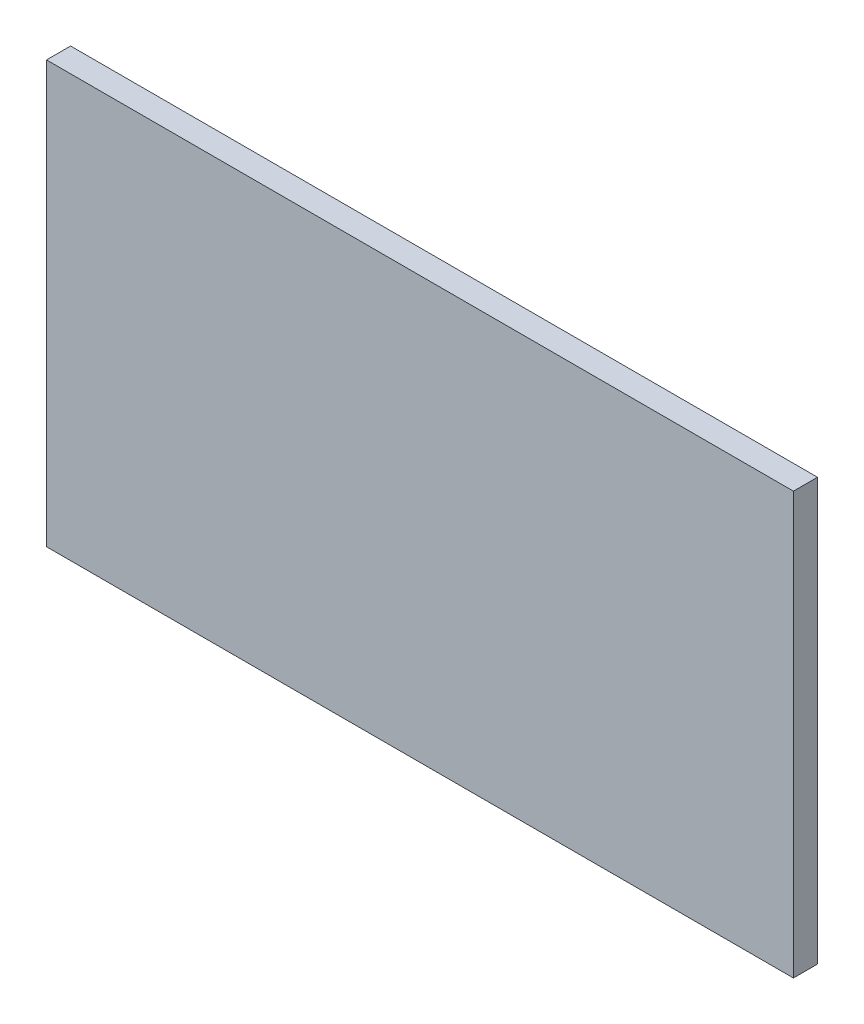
ISO-10303-21;
HEADER;
FILE_DESCRIPTION(('STEP AP214'),'2;1');
FILE_NAME('part.step','',(''),(''),'','','');
FILE_SCHEMA(('AUTOMOTIVE_DESIGN { 1 0 10303 214 1 1 1 1 }'));
ENDSEC;
DATA;
#1=APPLICATION_CONTEXT('core data for automotive mechanical design processes');
#2=APPLICATION_PROTOCOL_DEFINITION('international standard','automotive_design',2000,#1);
#3=PRODUCT_CONTEXT('',#1,'mechanical');
#4=PRODUCT('Part','Part','',(#3));
#5=PRODUCT_RELATED_PRODUCT_CATEGORY('part','',(#4));
#6=PRODUCT_DEFINITION_FORMATION('','',#4);
#7=PRODUCT_DEFINITION_CONTEXT('part definition',#1,'design');
#8=PRODUCT_DEFINITION('design','',#6,#7);
#9=PRODUCT_DEFINITION_SHAPE('','',#8);
#10=(LENGTH_UNIT() NAMED_UNIT(*) SI_UNIT(.MILLI.,.METRE.));
#11=(NAMED_UNIT(*) PLANE_ANGLE_UNIT() SI_UNIT($,.RADIAN.));
#12=(NAMED_UNIT(*) SI_UNIT($,.STERADIAN.) SOLID_ANGLE_UNIT());
#13=UNCERTAINTY_MEASURE_WITH_UNIT(LENGTH_MEASURE(1.E-05),#10,'distance_accuracy_value','');
#14=(GEOMETRIC_REPRESENTATION_CONTEXT(3) GLOBAL_UNCERTAINTY_ASSIGNED_CONTEXT((#13)) GLOBAL_UNIT_ASSIGNED_CONTEXT((#10,
#11,#12)) REPRESENTATION_CONTEXT('',''));
#15=CARTESIAN_POINT('',(0.,0.,0.));
#16=DIRECTION('',(0.,0.,1.));
#17=DIRECTION('',(1.,0.,0.));
#18=AXIS2_PLACEMENT_3D('',#15,#16,#17);
#19=CARTESIAN_POINT('',(310.,-175.,10.));
#20=DIRECTION('',(-1.,0.,0.));
#21=DIRECTION('',(0.,0.,1.));
#22=AXIS2_PLACEMENT_3D('',#19,#20,#21);
#23=PLANE('',#22);
#24=DIRECTION('',(0.,1.,0.));
#25=VECTOR('',#24,1.);
#26=CARTESIAN_POINT('',(310.,-175.,-10.));
#27=LINE('',#26,#25);
#28=CARTESIAN_POINT('',(310.,-175.,-10.));
#29=VERTEX_POINT('',#28);
#30=CARTESIAN_POINT('',(310.,175.,-10.));
#31=VERTEX_POINT('',#30);
#32=EDGE_CURVE('E96',#29,#31,#27,.T.);
#33=ORIENTED_EDGE('',*,*,#32,.T.);
#34=DIRECTION('',(0.,0.,-1.));
#35=VECTOR('',#34,1.);
#36=CARTESIAN_POINT('',(310.,175.,10.));
#37=LINE('',#36,#35);
#38=CARTESIAN_POINT('',(310.,175.,10.));
#39=VERTEX_POINT('',#38);
#40=EDGE_CURVE('E11',#39,#31,#37,.T.);
#41=ORIENTED_EDGE('',*,*,#40,.F.);
#42=DIRECTION('',(0.,1.,0.));
#43=VECTOR('',#42,1.);
#44=CARTESIAN_POINT('',(310.,-175.,10.));
#45=LINE('',#44,#43);
#46=CARTESIAN_POINT('',(310.,-175.,10.));
#47=VERTEX_POINT('',#46);
#48=EDGE_CURVE('E84',#47,#39,#45,.T.);
#49=ORIENTED_EDGE('',*,*,#48,.F.);
#50=DIRECTION('',(0.,0.,-1.));
#51=VECTOR('',#50,1.);
#52=CARTESIAN_POINT('',(310.,-175.,10.));
#53=LINE('',#52,#51);
#54=EDGE_CURVE('E92',#47,#29,#53,.T.);
#55=ORIENTED_EDGE('',*,*,#54,.T.);
#56=EDGE_LOOP('',(#33,#41,#49,#55));
#57=FACE_BOUND('',#56,.T.);
#58=ADVANCED_FACE('F33',(#57),#23,.F.);
#59=CARTESIAN_POINT('',(-310.,175.,10.));
#60=DIRECTION('',(0.,-1.,0.));
#61=DIRECTION('',(0.,0.,-1.));
#62=AXIS2_PLACEMENT_3D('',#59,#60,#61);
#63=PLANE('',#62);
#64=DIRECTION('',(-1.,0.,0.));
#65=VECTOR('',#64,1.);
#66=CARTESIAN_POINT('',(-310.,175.,-10.));
#67=LINE('',#66,#65);
#68=CARTESIAN_POINT('',(-310.,175.,-10.));
#69=VERTEX_POINT('',#68);
#70=EDGE_CURVE('E88',#31,#69,#67,.T.);
#71=ORIENTED_EDGE('',*,*,#70,.T.);
#72=DIRECTION('',(0.,0.,-1.));
#73=VECTOR('',#72,1.);
#74=CARTESIAN_POINT('',(-310.,175.,10.));
#75=LINE('',#74,#73);
#76=CARTESIAN_POINT('',(-310.,175.,10.));
#77=VERTEX_POINT('',#76);
#78=EDGE_CURVE('E41',#77,#69,#75,.T.);
#79=ORIENTED_EDGE('',*,*,#78,.F.);
#80=DIRECTION('',(-1.,0.,0.));
#81=VECTOR('',#80,1.);
#82=CARTESIAN_POINT('',(-310.,175.,10.));
#83=LINE('',#82,#81);
#84=EDGE_CURVE('E79',#39,#77,#83,.T.);
#85=ORIENTED_EDGE('',*,*,#84,.F.);
#86=ORIENTED_EDGE('',*,*,#40,.T.);
#87=EDGE_LOOP('',(#71,#79,#85,#86));
#88=FACE_BOUND('',#87,.T.);
#89=ADVANCED_FACE('F87',(#88),#63,.F.);
#90=CARTESIAN_POINT('',(-310.,-175.,10.));
#91=DIRECTION('',(1.,0.,0.));
#92=DIRECTION('',(0.,0.,-1.));
#93=AXIS2_PLACEMENT_3D('',#90,#91,#92);
#94=PLANE('',#93);
#95=DIRECTION('',(0.,-1.,0.));
#96=VECTOR('',#95,1.);
#97=CARTESIAN_POINT('',(-310.,-175.,-10.));
#98=LINE('',#97,#96);
#99=CARTESIAN_POINT('',(-310.,-175.,-10.));
#100=VERTEX_POINT('',#99);
#101=EDGE_CURVE('E66',#69,#100,#98,.T.);
#102=ORIENTED_EDGE('',*,*,#101,.T.);
#103=DIRECTION('',(0.,0.,-1.));
#104=VECTOR('',#103,1.);
#105=CARTESIAN_POINT('',(-310.,-175.,10.));
#106=LINE('',#105,#104);
#107=CARTESIAN_POINT('',(-310.,-175.,10.));
#108=VERTEX_POINT('',#107);
#109=EDGE_CURVE('E89',#108,#100,#106,.T.);
#110=ORIENTED_EDGE('',*,*,#109,.F.);
#111=DIRECTION('',(0.,-1.,0.));
#112=VECTOR('',#111,1.);
#113=CARTESIAN_POINT('',(-310.,-175.,10.));
#114=LINE('',#113,#112);
#115=EDGE_CURVE('E82',#77,#108,#114,.T.);
#116=ORIENTED_EDGE('',*,*,#115,.F.);
#117=ORIENTED_EDGE('',*,*,#78,.T.);
#118=EDGE_LOOP('',(#102,#110,#116,#117));
#119=FACE_BOUND('',#118,.T.);
#120=ADVANCED_FACE('F90',(#119),#94,.F.);
#121=CARTESIAN_POINT('',(-310.,-175.,10.));
#122=DIRECTION('',(0.,1.,0.));
#123=DIRECTION('',(0.,0.,1.));
#124=AXIS2_PLACEMENT_3D('',#121,#122,#123);
#125=PLANE('',#124);
#126=DIRECTION('',(1.,0.,0.));
#127=VECTOR('',#126,1.);
#128=CARTESIAN_POINT('',(-310.,-175.,-10.));
#129=LINE('',#128,#127);
#130=EDGE_CURVE('E72',#100,#29,#129,.T.);
#131=ORIENTED_EDGE('',*,*,#130,.T.);
#132=ORIENTED_EDGE('',*,*,#54,.F.);
#133=DIRECTION('',(1.,0.,0.));
#134=VECTOR('',#133,1.);
#135=CARTESIAN_POINT('',(-310.,-175.,10.));
#136=LINE('',#135,#134);
#137=EDGE_CURVE('E49',#108,#47,#136,.T.);
#138=ORIENTED_EDGE('',*,*,#137,.F.);
#139=ORIENTED_EDGE('',*,*,#109,.T.);
#140=EDGE_LOOP('',(#131,#132,#138,#139));
#141=FACE_BOUND('',#140,.T.);
#142=ADVANCED_FACE('F103',(#141),#125,.F.);
#143=CARTESIAN_POINT('',(0.,0.,10.));
#144=DIRECTION('',(0.,0.,-1.));
#145=DIRECTION('',(-1.,0.,0.));
#146=AXIS2_PLACEMENT_3D('',#143,#144,#145);
#147=PLANE('',#146);
#148=ORIENTED_EDGE('',*,*,#48,.T.);
#149=ORIENTED_EDGE('',*,*,#84,.T.);
#150=ORIENTED_EDGE('',*,*,#115,.T.);
#151=ORIENTED_EDGE('',*,*,#137,.T.);
#152=EDGE_LOOP('',(#148,#149,#150,#151));
#153=FACE_BOUND('',#152,.T.);
#154=ADVANCED_FACE('F80',(#153),#147,.F.);
#155=CARTESIAN_POINT('',(0.,0.,-10.));
#156=DIRECTION('',(0.,0.,-1.));
#157=DIRECTION('',(-1.,0.,0.));
#158=AXIS2_PLACEMENT_3D('',#155,#156,#157);
#159=PLANE('',#158);
#160=ORIENTED_EDGE('',*,*,#32,.F.);
#161=ORIENTED_EDGE('',*,*,#130,.F.);
#162=ORIENTED_EDGE('',*,*,#101,.F.);
#163=ORIENTED_EDGE('',*,*,#70,.F.);
#164=EDGE_LOOP('',(#160,#161,#162,#163));
#165=FACE_BOUND('',#164,.T.);
#166=ADVANCED_FACE('F106',(#165),#159,.T.);
#167=CLOSED_SHELL('',(#58,#89,#120,#142,#154,#166));
#168=MANIFOLD_SOLID_BREP('B2',#167);
#169=ADVANCED_BREP_SHAPE_REPRESENTATION('',(#18,#168),#14);
#170=SHAPE_DEFINITION_REPRESENTATION(#9,#169);
ENDSEC;
END-ISO-10303-21;
